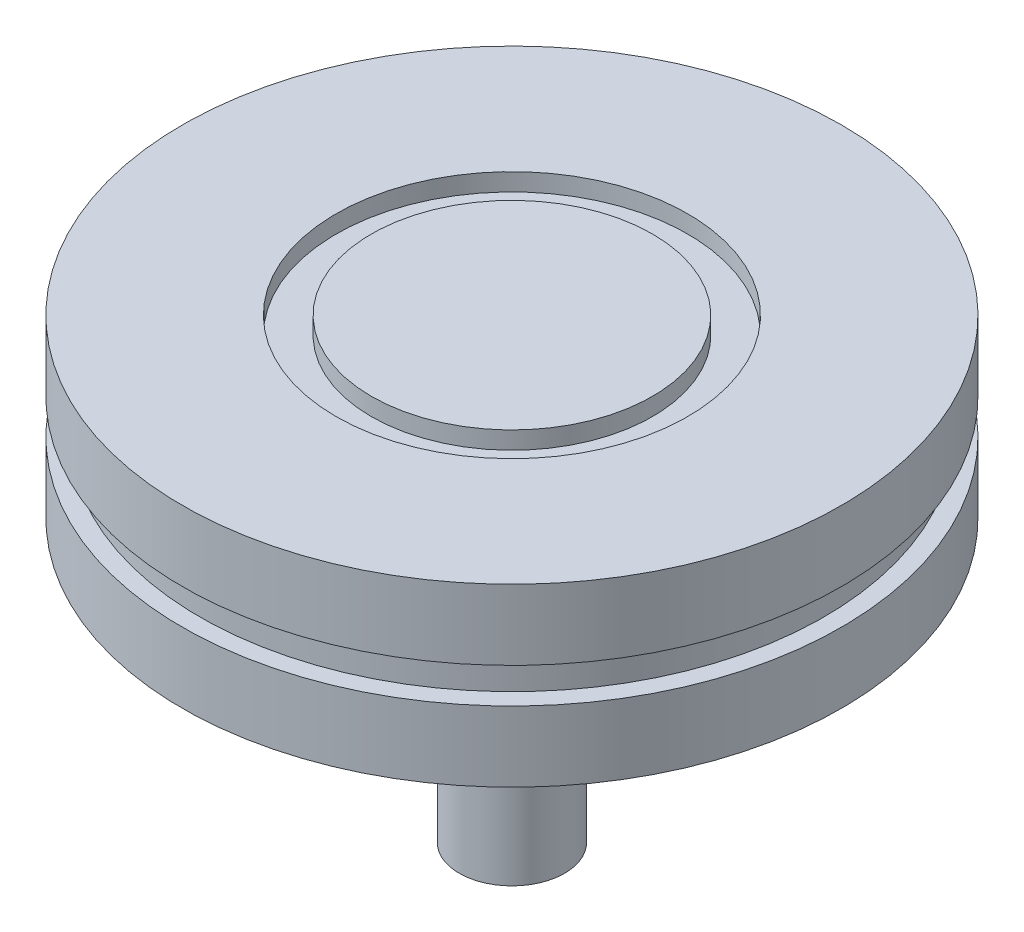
ISO-10303-21;
HEADER;
FILE_DESCRIPTION(('STEP AP214'),'2;1');
FILE_NAME('part.step','',(''),(''),'','','');
FILE_SCHEMA(('AUTOMOTIVE_DESIGN { 1 0 10303 214 1 1 1 1 }'));
ENDSEC;
DATA;
#1=APPLICATION_CONTEXT('core data for automotive mechanical design processes');
#2=APPLICATION_PROTOCOL_DEFINITION('international standard','automotive_design',2000,#1);
#3=PRODUCT_CONTEXT('',#1,'mechanical');
#4=PRODUCT('Part','Part','',(#3));
#5=PRODUCT_RELATED_PRODUCT_CATEGORY('part','',(#4));
#6=PRODUCT_DEFINITION_FORMATION('','',#4);
#7=PRODUCT_DEFINITION_CONTEXT('part definition',#1,'design');
#8=PRODUCT_DEFINITION('design','',#6,#7);
#9=PRODUCT_DEFINITION_SHAPE('','',#8);
#10=(LENGTH_UNIT() NAMED_UNIT(*) SI_UNIT(.MILLI.,.METRE.));
#11=(NAMED_UNIT(*) PLANE_ANGLE_UNIT() SI_UNIT($,.RADIAN.));
#12=(NAMED_UNIT(*) SI_UNIT($,.STERADIAN.) SOLID_ANGLE_UNIT());
#13=UNCERTAINTY_MEASURE_WITH_UNIT(LENGTH_MEASURE(1.E-05),#10,'distance_accuracy_value','');
#14=(GEOMETRIC_REPRESENTATION_CONTEXT(3) GLOBAL_UNCERTAINTY_ASSIGNED_CONTEXT((#13)) GLOBAL_UNIT_ASSIGNED_CONTEXT((#10,
#11,#12)) REPRESENTATION_CONTEXT('',''));
#15=CARTESIAN_POINT('',(0.,0.,0.));
#16=DIRECTION('',(0.,0.,1.));
#17=DIRECTION('',(1.,0.,0.));
#18=AXIS2_PLACEMENT_3D('',#15,#16,#17);
#19=CARTESIAN_POINT('',(0.,0.,0.));
#20=DIRECTION('',(0.,1.,0.));
#21=DIRECTION('',(0.,0.,1.));
#22=AXIS2_PLACEMENT_3D('',#19,#20,#21);
#23=PLANE('',#22);
#24=CARTESIAN_POINT('',(0.,0.,0.));
#25=DIRECTION('',(0.,-1.,0.));
#26=DIRECTION('',(0.,0.,-1.));
#27=AXIS2_PLACEMENT_3D('',#24,#25,#26);
#28=CIRCLE('',#27,2.0193);
#29=CARTESIAN_POINT('',(0.,0.,-2.0193));
#30=VERTEX_POINT('',#29);
#31=EDGE_CURVE('E67',#30,#30,#28,.T.);
#32=ORIENTED_EDGE('',*,*,#31,.F.);
#33=EDGE_LOOP('',(#32));
#34=FACE_BOUND('',#33,.T.);
#35=CARTESIAN_POINT('',(0.,0.,0.));
#36=DIRECTION('',(0.,-1.,0.));
#37=DIRECTION('',(0.,0.,-1.));
#38=AXIS2_PLACEMENT_3D('',#35,#36,#37);
#39=CIRCLE('',#38,3.81);
#40=CARTESIAN_POINT('',(0.,0.,-3.81));
#41=VERTEX_POINT('',#40);
#42=EDGE_CURVE('E11',#41,#41,#39,.T.);
#43=ORIENTED_EDGE('',*,*,#42,.T.);
#44=EDGE_LOOP('',(#43));
#45=FACE_BOUND('',#44,.T.);
#46=ADVANCED_FACE('F47',(#34,#45),#23,.F.);
#47=CARTESIAN_POINT('',(0.,0.,0.));
#48=DIRECTION('',(0.,-1.,0.));
#49=DIRECTION('',(0.,0.,-1.));
#50=AXIS2_PLACEMENT_3D('',#47,#48,#49);
#51=CYLINDRICAL_SURFACE('',#50,3.81);
#52=ORIENTED_EDGE('',*,*,#42,.F.);
#53=EDGE_LOOP('',(#52));
#54=FACE_BOUND('',#53,.T.);
#55=CARTESIAN_POINT('',(0.,20.32,0.));
#56=DIRECTION('',(0.,-1.,0.));
#57=DIRECTION('',(0.,0.,-1.));
#58=AXIS2_PLACEMENT_3D('',#55,#56,#57);
#59=CIRCLE('',#58,3.81);
#60=CARTESIAN_POINT('',(0.,20.32,-3.81));
#61=VERTEX_POINT('',#60);
#62=EDGE_CURVE('E53',#61,#61,#59,.T.);
#63=ORIENTED_EDGE('',*,*,#62,.T.);
#64=EDGE_LOOP('',(#63));
#65=FACE_BOUND('',#64,.T.);
#66=ADVANCED_FACE('F93',(#54,#65),#51,.T.);
#67=CARTESIAN_POINT('',(-3.81,20.32,0.));
#68=DIRECTION('',(0.,1.,0.));
#69=DIRECTION('',(0.,0.,1.));
#70=AXIS2_PLACEMENT_3D('',#67,#68,#69);
#71=PLANE('',#70);
#72=ORIENTED_EDGE('',*,*,#62,.F.);
#73=EDGE_LOOP('',(#72));
#74=FACE_BOUND('',#73,.T.);
#75=CARTESIAN_POINT('',(0.,20.32,0.));
#76=DIRECTION('',(0.,-1.,0.));
#77=DIRECTION('',(0.,0.,-1.));
#78=AXIS2_PLACEMENT_3D('',#75,#76,#77);
#79=CIRCLE('',#78,23.8125);
#80=CARTESIAN_POINT('',(0.,20.32,-23.8125));
#81=VERTEX_POINT('',#80);
#82=EDGE_CURVE('E88',#81,#81,#79,.T.);
#83=ORIENTED_EDGE('',*,*,#82,.T.);
#84=EDGE_LOOP('',(#83));
#85=FACE_BOUND('',#84,.T.);
#86=ADVANCED_FACE('F95',(#74,#85),#71,.F.);
#87=CARTESIAN_POINT('',(0.,0.,0.));
#88=DIRECTION('',(0.,-1.,0.));
#89=DIRECTION('',(0.,0.,-1.));
#90=AXIS2_PLACEMENT_3D('',#87,#88,#89);
#91=CYLINDRICAL_SURFACE('',#90,23.8125);
#92=ORIENTED_EDGE('',*,*,#82,.F.);
#93=EDGE_LOOP('',(#92));
#94=FACE_BOUND('',#93,.T.);
#95=CARTESIAN_POINT('',(0.,25.4,0.));
#96=DIRECTION('',(0.,-1.,0.));
#97=DIRECTION('',(0.,0.,-1.));
#98=AXIS2_PLACEMENT_3D('',#95,#96,#97);
#99=CIRCLE('',#98,23.8125);
#100=CARTESIAN_POINT('',(0.,25.4,-23.8125));
#101=VERTEX_POINT('',#100);
#102=EDGE_CURVE('E85',#101,#101,#99,.T.);
#103=ORIENTED_EDGE('',*,*,#102,.T.);
#104=EDGE_LOOP('',(#103));
#105=FACE_BOUND('',#104,.T.);
#106=ADVANCED_FACE('F98',(#94,#105),#91,.T.);
#107=CARTESIAN_POINT('',(-23.8125,25.4,0.));
#108=DIRECTION('',(0.,-1.,0.));
#109=DIRECTION('',(0.,0.,-1.));
#110=AXIS2_PLACEMENT_3D('',#107,#108,#109);
#111=PLANE('',#110);
#112=ORIENTED_EDGE('',*,*,#102,.F.);
#113=EDGE_LOOP('',(#112));
#114=FACE_BOUND('',#113,.T.);
#115=CARTESIAN_POINT('',(0.,25.4,0.));
#116=DIRECTION('',(0.,-1.,0.));
#117=DIRECTION('',(0.,0.,-1.));
#118=AXIS2_PLACEMENT_3D('',#115,#116,#117);
#119=CIRCLE('',#118,22.5425);
#120=CARTESIAN_POINT('',(0.,25.4,-22.5425));
#121=VERTEX_POINT('',#120);
#122=EDGE_CURVE('E82',#121,#121,#119,.T.);
#123=ORIENTED_EDGE('',*,*,#122,.T.);
#124=EDGE_LOOP('',(#123));
#125=FACE_BOUND('',#124,.T.);
#126=ADVANCED_FACE('F104',(#114,#125),#111,.F.);
#127=CARTESIAN_POINT('',(0.,0.,0.));
#128=DIRECTION('',(0.,-1.,0.));
#129=DIRECTION('',(0.,0.,-1.));
#130=AXIS2_PLACEMENT_3D('',#127,#128,#129);
#131=CYLINDRICAL_SURFACE('',#130,22.5425);
#132=ORIENTED_EDGE('',*,*,#122,.F.);
#133=EDGE_LOOP('',(#132));
#134=FACE_BOUND('',#133,.T.);
#135=CARTESIAN_POINT('',(0.,27.94,0.));
#136=DIRECTION('',(0.,-1.,0.));
#137=DIRECTION('',(0.,0.,-1.));
#138=AXIS2_PLACEMENT_3D('',#135,#136,#137);
#139=CIRCLE('',#138,22.5425);
#140=CARTESIAN_POINT('',(0.,27.94,-22.5425));
#141=VERTEX_POINT('',#140);
#142=EDGE_CURVE('E79',#141,#141,#139,.T.);
#143=ORIENTED_EDGE('',*,*,#142,.T.);
#144=EDGE_LOOP('',(#143));
#145=FACE_BOUND('',#144,.T.);
#146=ADVANCED_FACE('F110',(#134,#145),#131,.T.);
#147=CARTESIAN_POINT('',(-22.5425,27.94,0.));
#148=DIRECTION('',(0.,1.,0.));
#149=DIRECTION('',(0.,0.,1.));
#150=AXIS2_PLACEMENT_3D('',#147,#148,#149);
#151=PLANE('',#150);
#152=ORIENTED_EDGE('',*,*,#142,.F.);
#153=EDGE_LOOP('',(#152));
#154=FACE_BOUND('',#153,.T.);
#155=CARTESIAN_POINT('',(0.,27.94,0.));
#156=DIRECTION('',(0.,-1.,0.));
#157=DIRECTION('',(0.,0.,-1.));
#158=AXIS2_PLACEMENT_3D('',#155,#156,#157);
#159=CIRCLE('',#158,23.8125);
#160=CARTESIAN_POINT('',(0.,27.94,-23.8125));
#161=VERTEX_POINT('',#160);
#162=EDGE_CURVE('E70',#161,#161,#159,.T.);
#163=ORIENTED_EDGE('',*,*,#162,.T.);
#164=EDGE_LOOP('',(#163));
#165=FACE_BOUND('',#164,.T.);
#166=ADVANCED_FACE('F116',(#154,#165),#151,.F.);
#167=CARTESIAN_POINT('',(0.,0.,0.));
#168=DIRECTION('',(0.,-1.,0.));
#169=DIRECTION('',(0.,0.,-1.));
#170=AXIS2_PLACEMENT_3D('',#167,#168,#169);
#171=CYLINDRICAL_SURFACE('',#170,23.8125);
#172=ORIENTED_EDGE('',*,*,#162,.F.);
#173=EDGE_LOOP('',(#172));
#174=FACE_BOUND('',#173,.T.);
#175=CARTESIAN_POINT('',(0.,33.02,0.));
#176=DIRECTION('',(0.,-1.,0.));
#177=DIRECTION('',(0.,0.,-1.));
#178=AXIS2_PLACEMENT_3D('',#175,#176,#177);
#179=CIRCLE('',#178,23.8125);
#180=CARTESIAN_POINT('',(0.,33.02,-23.8125));
#181=VERTEX_POINT('',#180);
#182=EDGE_CURVE('E66',#181,#181,#179,.T.);
#183=ORIENTED_EDGE('',*,*,#182,.T.);
#184=EDGE_LOOP('',(#183));
#185=FACE_BOUND('',#184,.T.);
#186=ADVANCED_FACE('F122',(#174,#185),#171,.T.);
#187=CARTESIAN_POINT('',(-23.8125,33.02,0.));
#188=DIRECTION('',(0.,-1.,0.));
#189=DIRECTION('',(0.,0.,-1.));
#190=AXIS2_PLACEMENT_3D('',#187,#188,#189);
#191=PLANE('',#190);
#192=CARTESIAN_POINT('',(0.,33.02,0.));
#193=DIRECTION('',(0.,1.,0.));
#194=DIRECTION('',(0.,0.,1.));
#195=AXIS2_PLACEMENT_3D('',#192,#193,#194);
#196=CIRCLE('',#195,12.7);
#197=CARTESIAN_POINT('',(0.,33.02,12.7));
#198=VERTEX_POINT('',#197);
#199=EDGE_CURVE('E177',#198,#198,#196,.T.);
#200=ORIENTED_EDGE('',*,*,#199,.F.);
#201=EDGE_LOOP('',(#200));
#202=FACE_BOUND('',#201,.T.);
#203=ORIENTED_EDGE('',*,*,#182,.F.);
#204=EDGE_LOOP('',(#203));
#205=FACE_BOUND('',#204,.T.);
#206=ADVANCED_FACE('F60',(#202,#205),#191,.F.);
#207=CARTESIAN_POINT('',(0.,7.62,0.));
#208=DIRECTION('',(0.,-1.,0.));
#209=DIRECTION('',(0.,0.,-1.));
#210=AXIS2_PLACEMENT_3D('',#207,#208,#209);
#211=CONICAL_SURFACE('',#210,2.0193,1.02974425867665);
#212=CARTESIAN_POINT('',(0.,8.83331784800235,0.));
#213=VERTEX_POINT('',#212);
#214=VERTEX_LOOP('',#213);
#215=FACE_BOUND('',#214,.T.);
#216=CARTESIAN_POINT('',(0.,7.62,0.));
#217=DIRECTION('',(0.,-1.,0.));
#218=DIRECTION('',(0.,0.,-1.));
#219=AXIS2_PLACEMENT_3D('',#216,#217,#218);
#220=CIRCLE('',#219,2.0193);
#221=CARTESIAN_POINT('',(0.,7.62,-2.0193));
#222=VERTEX_POINT('',#221);
#223=EDGE_CURVE('E64',#222,#222,#220,.T.);
#224=ORIENTED_EDGE('',*,*,#223,.T.);
#225=EDGE_LOOP('',(#224));
#226=FACE_BOUND('',#225,.T.);
#227=ADVANCED_FACE('F56',(#215,#226),#211,.F.);
#228=CARTESIAN_POINT('',(0.,0.,0.));
#229=DIRECTION('',(0.,-1.,0.));
#230=DIRECTION('',(0.,0.,-1.));
#231=AXIS2_PLACEMENT_3D('',#228,#229,#230);
#232=CYLINDRICAL_SURFACE('',#231,2.0193);
#233=ORIENTED_EDGE('',*,*,#223,.F.);
#234=EDGE_LOOP('',(#233));
#235=FACE_BOUND('',#234,.T.);
#236=ORIENTED_EDGE('',*,*,#31,.T.);
#237=EDGE_LOOP('',(#236));
#238=FACE_BOUND('',#237,.T.);
#239=ADVANCED_FACE('F59',(#235,#238),#232,.F.);
#240=CARTESIAN_POINT('',(0.,31.75,0.));
#241=DIRECTION('',(0.,1.,0.));
#242=DIRECTION('',(0.,0.,1.));
#243=AXIS2_PLACEMENT_3D('',#240,#241,#242);
#244=CYLINDRICAL_SURFACE('',#243,12.7);
#245=CARTESIAN_POINT('',(0.,31.75,0.));
#246=DIRECTION('',(0.,1.,0.));
#247=DIRECTION('',(0.,0.,1.));
#248=AXIS2_PLACEMENT_3D('',#245,#246,#247);
#249=CIRCLE('',#248,12.7);
#250=CARTESIAN_POINT('',(0.,31.75,12.7));
#251=VERTEX_POINT('',#250);
#252=EDGE_CURVE('E73',#251,#251,#249,.T.);
#253=ORIENTED_EDGE('',*,*,#252,.F.);
#254=EDGE_LOOP('',(#253));
#255=FACE_BOUND('',#254,.T.);
#256=ORIENTED_EDGE('',*,*,#199,.T.);
#257=EDGE_LOOP('',(#256));
#258=FACE_BOUND('',#257,.T.);
#259=ADVANCED_FACE('F154',(#255,#258),#244,.F.);
#260=CARTESIAN_POINT('',(0.,31.75,0.));
#261=DIRECTION('',(0.,1.,0.));
#262=DIRECTION('',(0.,0.,1.));
#263=AXIS2_PLACEMENT_3D('',#260,#261,#262);
#264=PLANE('',#263);
#265=CARTESIAN_POINT('',(0.,31.75,0.));
#266=DIRECTION('',(0.,1.,0.));
#267=DIRECTION('',(0.,0.,1.));
#268=AXIS2_PLACEMENT_3D('',#265,#266,#267);
#269=CIRCLE('',#268,10.16);
#270=CARTESIAN_POINT('',(0.,31.75,10.16));
#271=VERTEX_POINT('',#270);
#272=EDGE_CURVE('E172',#271,#271,#269,.T.);
#273=ORIENTED_EDGE('',*,*,#272,.F.);
#274=EDGE_LOOP('',(#273));
#275=FACE_BOUND('',#274,.T.);
#276=ORIENTED_EDGE('',*,*,#252,.T.);
#277=EDGE_LOOP('',(#276));
#278=FACE_BOUND('',#277,.T.);
#279=ADVANCED_FACE('F158',(#275,#278),#264,.T.);
#280=CARTESIAN_POINT('',(0.,31.75,0.));
#281=DIRECTION('',(0.,1.,0.));
#282=DIRECTION('',(0.,0.,1.));
#283=AXIS2_PLACEMENT_3D('',#280,#281,#282);
#284=CYLINDRICAL_SURFACE('',#283,10.16);
#285=ORIENTED_EDGE('',*,*,#272,.T.);
#286=EDGE_LOOP('',(#285));
#287=FACE_BOUND('',#286,.T.);
#288=CARTESIAN_POINT('',(0.,33.02,0.));
#289=DIRECTION('',(0.,1.,0.));
#290=DIRECTION('',(0.,0.,1.));
#291=AXIS2_PLACEMENT_3D('',#288,#289,#290);
#292=CIRCLE('',#291,10.16);
#293=CARTESIAN_POINT('',(0.,33.02,10.16));
#294=VERTEX_POINT('',#293);
#295=EDGE_CURVE('E175',#294,#294,#292,.T.);
#296=ORIENTED_EDGE('',*,*,#295,.F.);
#297=EDGE_LOOP('',(#296));
#298=FACE_BOUND('',#297,.T.);
#299=ADVANCED_FACE('F141',(#287,#298),#284,.T.);
#300=ORIENTED_EDGE('',*,*,#295,.T.);
#301=EDGE_LOOP('',(#300));
#302=FACE_BOUND('',#301,.T.);
#303=ADVANCED_FACE('F134',(#302),#191,.F.);
#304=CLOSED_SHELL('',(#46,#66,#86,#106,#126,#146,#166,#186,#206,#227,#239,#259,#279,#299,#303));
#305=MANIFOLD_SOLID_BREP('B2',#304);
#306=ADVANCED_BREP_SHAPE_REPRESENTATION('',(#18,#305),#14);
#307=SHAPE_DEFINITION_REPRESENTATION(#9,#306);
ENDSEC;
END-ISO-10303-21;
